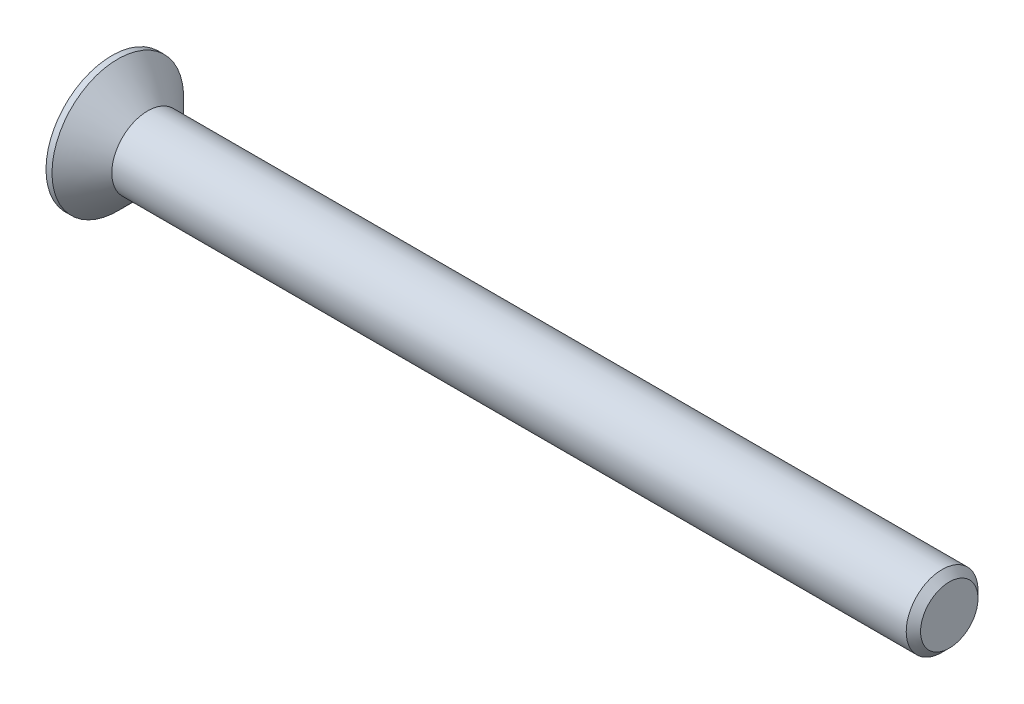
ISO-10303-21;
HEADER;
FILE_DESCRIPTION(('STEP AP214'),'2;1');
FILE_NAME('part.step','',(''),(''),'','','');
FILE_SCHEMA(('AUTOMOTIVE_DESIGN { 1 0 10303 214 1 1 1 1 }'));
ENDSEC;
DATA;
#1=APPLICATION_CONTEXT('core data for automotive mechanical design processes');
#2=APPLICATION_PROTOCOL_DEFINITION('international standard','automotive_design',2000,#1);
#3=PRODUCT_CONTEXT('',#1,'mechanical');
#4=PRODUCT('Part','Part','',(#3));
#5=PRODUCT_RELATED_PRODUCT_CATEGORY('part','',(#4));
#6=PRODUCT_DEFINITION_FORMATION('','',#4);
#7=PRODUCT_DEFINITION_CONTEXT('part definition',#1,'design');
#8=PRODUCT_DEFINITION('design','',#6,#7);
#9=PRODUCT_DEFINITION_SHAPE('','',#8);
#10=(LENGTH_UNIT() NAMED_UNIT(*) SI_UNIT(.MILLI.,.METRE.));
#11=(NAMED_UNIT(*) PLANE_ANGLE_UNIT() SI_UNIT($,.RADIAN.));
#12=(NAMED_UNIT(*) SI_UNIT($,.STERADIAN.) SOLID_ANGLE_UNIT());
#13=UNCERTAINTY_MEASURE_WITH_UNIT(LENGTH_MEASURE(1.E-05),#10,'distance_accuracy_value','');
#14=(GEOMETRIC_REPRESENTATION_CONTEXT(3) GLOBAL_UNCERTAINTY_ASSIGNED_CONTEXT((#13)) GLOBAL_UNIT_ASSIGNED_CONTEXT((#10,
#11,#12)) REPRESENTATION_CONTEXT('',''));
#15=CARTESIAN_POINT('',(0.,0.,0.));
#16=DIRECTION('',(0.,0.,1.));
#17=DIRECTION('',(1.,0.,0.));
#18=AXIS2_PLACEMENT_3D('',#15,#16,#17);
#19=CARTESIAN_POINT('',(0.,0.,0.));
#20=DIRECTION('',(-1.,0.,0.));
#21=DIRECTION('',(0.,0.,1.));
#22=AXIS2_PLACEMENT_3D('',#19,#20,#21);
#23=CONICAL_SURFACE('',#22,3.,0.78539816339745);
#24=CARTESIAN_POINT('',(-2.49999999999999,0.,0.));
#25=DIRECTION('',(-1.,0.,0.));
#26=DIRECTION('',(0.,0.,1.));
#27=AXIS2_PLACEMENT_3D('',#24,#25,#26);
#28=CIRCLE('',#27,5.5);
#29=CARTESIAN_POINT('',(-2.49999999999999,0.,5.5));
#30=VERTEX_POINT('',#29);
#31=EDGE_CURVE('E189',#30,#30,#28,.T.);
#32=ORIENTED_EDGE('',*,*,#31,.F.);
#33=EDGE_LOOP('',(#32));
#34=FACE_BOUND('',#33,.T.);
#35=CARTESIAN_POINT('',(0.,0.,0.));
#36=DIRECTION('',(-1.,0.,0.));
#37=DIRECTION('',(0.,0.,1.));
#38=AXIS2_PLACEMENT_3D('',#35,#36,#37);
#39=CIRCLE('',#38,3.);
#40=CARTESIAN_POINT('',(0.,0.,3.));
#41=VERTEX_POINT('',#40);
#42=EDGE_CURVE('E212',#41,#41,#39,.T.);
#43=ORIENTED_EDGE('',*,*,#42,.T.);
#44=EDGE_LOOP('',(#43));
#45=FACE_BOUND('',#44,.T.);
#46=ADVANCED_FACE('F33',(#34,#45),#23,.T.);
#47=CARTESIAN_POINT('',(-3.,0.,0.));
#48=DIRECTION('',(-1.,0.,0.));
#49=DIRECTION('',(0.,0.,1.));
#50=AXIS2_PLACEMENT_3D('',#47,#48,#49);
#51=CYLINDRICAL_SURFACE('',#50,3.);
#52=CARTESIAN_POINT('',(66.4,0.,0.));
#53=DIRECTION('',(-1.,0.,0.));
#54=DIRECTION('',(0.,0.,1.));
#55=AXIS2_PLACEMENT_3D('',#52,#53,#54);
#56=CIRCLE('',#55,3.);
#57=CARTESIAN_POINT('',(66.4,0.,3.));
#58=VERTEX_POINT('',#57);
#59=EDGE_CURVE('E41',#58,#58,#56,.T.);
#60=ORIENTED_EDGE('',*,*,#59,.T.);
#61=EDGE_LOOP('',(#60));
#62=FACE_BOUND('',#61,.T.);
#63=ORIENTED_EDGE('',*,*,#42,.F.);
#64=EDGE_LOOP('',(#63));
#65=FACE_BOUND('',#64,.T.);
#66=ADVANCED_FACE('F217',(#62,#65),#51,.T.);
#67=CARTESIAN_POINT('',(67.,0.,0.));
#68=DIRECTION('',(-1.,0.,0.));
#69=DIRECTION('',(0.,0.,1.));
#70=AXIS2_PLACEMENT_3D('',#67,#68,#69);
#71=PLANE('',#70);
#72=CARTESIAN_POINT('',(67.,0.,0.));
#73=DIRECTION('',(-1.,0.,0.));
#74=DIRECTION('',(0.,0.,1.));
#75=AXIS2_PLACEMENT_3D('',#72,#73,#74);
#76=CIRCLE('',#75,2.4);
#77=CARTESIAN_POINT('',(67.,0.,2.4));
#78=VERTEX_POINT('',#77);
#79=EDGE_CURVE('E11',#78,#78,#76,.F.);
#80=ORIENTED_EDGE('',*,*,#79,.T.);
#81=EDGE_LOOP('',(#80));
#82=FACE_BOUND('',#81,.T.);
#83=ADVANCED_FACE('F239',(#82),#71,.F.);
#84=CARTESIAN_POINT('',(-3.,5.5,0.));
#85=DIRECTION('',(1.,0.,0.));
#86=DIRECTION('',(0.,0.,-1.));
#87=AXIS2_PLACEMENT_3D('',#84,#85,#86);
#88=PLANE('',#87);
#89=DIRECTION('',(0.,0.,-1.));
#90=VECTOR('',#89,1.);
#91=CARTESIAN_POINT('',(-3.,0.825,-3.3));
#92=LINE('',#91,#90);
#93=CARTESIAN_POINT('',(-3.,0.825,-0.825));
#94=VERTEX_POINT('',#93);
#95=CARTESIAN_POINT('',(-3.,0.825,-3.3));
#96=VERTEX_POINT('',#95);
#97=EDGE_CURVE('E158',#94,#96,#92,.T.);
#98=ORIENTED_EDGE('',*,*,#97,.F.);
#99=DIRECTION('',(0.,-1.,0.));
#100=VECTOR('',#99,1.);
#101=CARTESIAN_POINT('',(-3.,0.825,-0.825));
#102=LINE('',#101,#100);
#103=CARTESIAN_POINT('',(-3.,3.3,-0.825));
#104=VERTEX_POINT('',#103);
#105=EDGE_CURVE('E48',#104,#94,#102,.T.);
#106=ORIENTED_EDGE('',*,*,#105,.F.);
#107=DIRECTION('',(0.,0.,-1.));
#108=VECTOR('',#107,1.);
#109=CARTESIAN_POINT('',(-3.,3.3,-0.825));
#110=LINE('',#109,#108);
#111=CARTESIAN_POINT('',(-3.,3.3,0.825));
#112=VERTEX_POINT('',#111);
#113=EDGE_CURVE('E185',#112,#104,#110,.T.);
#114=ORIENTED_EDGE('',*,*,#113,.F.);
#115=DIRECTION('',(0.,1.,0.));
#116=VECTOR('',#115,1.);
#117=CARTESIAN_POINT('',(-3.,3.3,0.825));
#118=LINE('',#117,#116);
#119=CARTESIAN_POINT('',(-3.,0.825,0.825));
#120=VERTEX_POINT('',#119);
#121=EDGE_CURVE('E183',#120,#112,#118,.T.);
#122=ORIENTED_EDGE('',*,*,#121,.F.);
#123=DIRECTION('',(0.,0.,-1.));
#124=VECTOR('',#123,1.);
#125=CARTESIAN_POINT('',(-3.,0.825,0.825));
#126=LINE('',#125,#124);
#127=CARTESIAN_POINT('',(-3.,0.825,3.3));
#128=VERTEX_POINT('',#127);
#129=EDGE_CURVE('E132',#128,#120,#126,.T.);
#130=ORIENTED_EDGE('',*,*,#129,.F.);
#131=DIRECTION('',(0.,1.,0.));
#132=VECTOR('',#131,1.);
#133=CARTESIAN_POINT('',(-3.,0.825,3.3));
#134=LINE('',#133,#132);
#135=CARTESIAN_POINT('',(-3.,-0.825,3.3));
#136=VERTEX_POINT('',#135);
#137=EDGE_CURVE('E179',#136,#128,#134,.T.);
#138=ORIENTED_EDGE('',*,*,#137,.F.);
#139=DIRECTION('',(0.,0.,1.));
#140=VECTOR('',#139,1.);
#141=CARTESIAN_POINT('',(-3.,-0.825,3.3));
#142=LINE('',#141,#140);
#143=CARTESIAN_POINT('',(-3.,-0.825,0.825));
#144=VERTEX_POINT('',#143);
#145=EDGE_CURVE('E176',#144,#136,#142,.T.);
#146=ORIENTED_EDGE('',*,*,#145,.F.);
#147=DIRECTION('',(0.,1.,0.));
#148=VECTOR('',#147,1.);
#149=CARTESIAN_POINT('',(-3.,-0.825,0.825));
#150=LINE('',#149,#148);
#151=CARTESIAN_POINT('',(-3.,-3.3,0.825));
#152=VERTEX_POINT('',#151);
#153=EDGE_CURVE('E173',#152,#144,#150,.T.);
#154=ORIENTED_EDGE('',*,*,#153,.F.);
#155=DIRECTION('',(0.,0.,1.));
#156=VECTOR('',#155,1.);
#157=CARTESIAN_POINT('',(-3.,-3.3,0.825));
#158=LINE('',#157,#156);
#159=CARTESIAN_POINT('',(-3.,-3.3,-0.825));
#160=VERTEX_POINT('',#159);
#161=EDGE_CURVE('E170',#160,#152,#158,.T.);
#162=ORIENTED_EDGE('',*,*,#161,.F.);
#163=DIRECTION('',(0.,-1.,0.));
#164=VECTOR('',#163,1.);
#165=CARTESIAN_POINT('',(-3.,-3.3,-0.825));
#166=LINE('',#165,#164);
#167=CARTESIAN_POINT('',(-3.,-0.825,-0.825));
#168=VERTEX_POINT('',#167);
#169=EDGE_CURVE('E167',#168,#160,#166,.T.);
#170=ORIENTED_EDGE('',*,*,#169,.F.);
#171=DIRECTION('',(0.,0.,1.));
#172=VECTOR('',#171,1.);
#173=CARTESIAN_POINT('',(-3.,-0.825,-0.825));
#174=LINE('',#173,#172);
#175=CARTESIAN_POINT('',(-3.,-0.825,-3.3));
#176=VERTEX_POINT('',#175);
#177=EDGE_CURVE('E164',#176,#168,#174,.T.);
#178=ORIENTED_EDGE('',*,*,#177,.F.);
#179=DIRECTION('',(0.,-1.,0.));
#180=VECTOR('',#179,1.);
#181=CARTESIAN_POINT('',(-3.,-0.825,-3.3));
#182=LINE('',#181,#180);
#183=EDGE_CURVE('E161',#96,#176,#182,.T.);
#184=ORIENTED_EDGE('',*,*,#183,.F.);
#185=EDGE_LOOP('',(#98,#106,#114,#122,#130,#138,#146,#154,#162,#170,#178,#184));
#186=FACE_BOUND('',#185,.T.);
#187=CARTESIAN_POINT('',(-3.,0.,0.));
#188=DIRECTION('',(-1.,0.,0.));
#189=DIRECTION('',(0.,0.,1.));
#190=AXIS2_PLACEMENT_3D('',#187,#188,#189);
#191=CIRCLE('',#190,5.5);
#192=CARTESIAN_POINT('',(-3.,0.,5.5));
#193=VERTEX_POINT('',#192);
#194=EDGE_CURVE('E209',#193,#193,#191,.T.);
#195=ORIENTED_EDGE('',*,*,#194,.T.);
#196=EDGE_LOOP('',(#195));
#197=FACE_BOUND('',#196,.T.);
#198=ADVANCED_FACE('F230',(#186,#197),#88,.F.);
#199=CARTESIAN_POINT('',(-3.,0.,0.));
#200=DIRECTION('',(-1.,0.,0.));
#201=DIRECTION('',(0.,0.,1.));
#202=AXIS2_PLACEMENT_3D('',#199,#200,#201);
#203=CYLINDRICAL_SURFACE('',#202,5.5);
#204=ORIENTED_EDGE('',*,*,#194,.F.);
#205=EDGE_LOOP('',(#204));
#206=FACE_BOUND('',#205,.T.);
#207=ORIENTED_EDGE('',*,*,#31,.T.);
#208=EDGE_LOOP('',(#207));
#209=FACE_BOUND('',#208,.T.);
#210=ADVANCED_FACE('F222',(#206,#209),#203,.T.);
#211=CARTESIAN_POINT('',(66.4,0.,0.));
#212=DIRECTION('',(-1.,0.,0.));
#213=DIRECTION('',(0.,0.,1.));
#214=AXIS2_PLACEMENT_3D('',#211,#212,#213);
#215=CONICAL_SURFACE('',#214,3.,0.785398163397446);
#216=ORIENTED_EDGE('',*,*,#79,.F.);
#217=EDGE_LOOP('',(#216));
#218=FACE_BOUND('',#217,.T.);
#219=ORIENTED_EDGE('',*,*,#59,.F.);
#220=EDGE_LOOP('',(#219));
#221=FACE_BOUND('',#220,.T.);
#222=ADVANCED_FACE('F35',(#218,#221),#215,.T.);
#223=CARTESIAN_POINT('',(-0.5,0.825,-0.825));
#224=DIRECTION('',(0.,0.,-1.));
#225=DIRECTION('',(-1.,0.,0.));
#226=AXIS2_PLACEMENT_3D('',#223,#224,#225);
#227=PLANE('',#226);
#228=ORIENTED_EDGE('',*,*,#105,.T.);
#229=DIRECTION('',(-1.,0.,0.));
#230=VECTOR('',#229,1.);
#231=CARTESIAN_POINT('',(-0.5,0.825,-0.825));
#232=LINE('',#231,#230);
#233=CARTESIAN_POINT('',(-0.5,0.825,-0.825));
#234=VERTEX_POINT('',#233);
#235=EDGE_CURVE('E96',#234,#94,#232,.T.);
#236=ORIENTED_EDGE('',*,*,#235,.F.);
#237=DIRECTION('',(0.,-1.,0.));
#238=VECTOR('',#237,1.);
#239=CARTESIAN_POINT('',(-0.5,0.825,-0.825));
#240=LINE('',#239,#238);
#241=CARTESIAN_POINT('',(-0.5,3.3,-0.825));
#242=VERTEX_POINT('',#241);
#243=EDGE_CURVE('E187',#242,#234,#240,.T.);
#244=ORIENTED_EDGE('',*,*,#243,.F.);
#245=DIRECTION('',(-1.,0.,0.));
#246=VECTOR('',#245,1.);
#247=CARTESIAN_POINT('',(-0.5,3.3,-0.825));
#248=LINE('',#247,#246);
#249=EDGE_CURVE('E56',#242,#104,#248,.T.);
#250=ORIENTED_EDGE('',*,*,#249,.T.);
#251=EDGE_LOOP('',(#228,#236,#244,#250));
#252=FACE_BOUND('',#251,.T.);
#253=ADVANCED_FACE('F221',(#252),#227,.F.);
#254=CARTESIAN_POINT('',(-0.5,3.3,-0.825));
#255=DIRECTION('',(0.,1.,0.));
#256=DIRECTION('',(-1.,0.,0.));
#257=AXIS2_PLACEMENT_3D('',#254,#255,#256);
#258=PLANE('',#257);
#259=ORIENTED_EDGE('',*,*,#113,.T.);
#260=ORIENTED_EDGE('',*,*,#249,.F.);
#261=DIRECTION('',(0.,0.,-1.));
#262=VECTOR('',#261,1.);
#263=CARTESIAN_POINT('',(-0.5,3.3,-0.825));
#264=LINE('',#263,#262);
#265=CARTESIAN_POINT('',(-0.5,3.3,0.825));
#266=VERTEX_POINT('',#265);
#267=EDGE_CURVE('E144',#266,#242,#264,.T.);
#268=ORIENTED_EDGE('',*,*,#267,.F.);
#269=DIRECTION('',(-1.,0.,0.));
#270=VECTOR('',#269,1.);
#271=CARTESIAN_POINT('',(-0.5,3.3,0.825));
#272=LINE('',#271,#270);
#273=EDGE_CURVE('E136',#266,#112,#272,.T.);
#274=ORIENTED_EDGE('',*,*,#273,.T.);
#275=EDGE_LOOP('',(#259,#260,#268,#274));
#276=FACE_BOUND('',#275,.T.);
#277=ADVANCED_FACE('F228',(#276),#258,.F.);
#278=CARTESIAN_POINT('',(-0.5,3.3,0.825));
#279=DIRECTION('',(0.,0.,1.));
#280=DIRECTION('',(1.,0.,0.));
#281=AXIS2_PLACEMENT_3D('',#278,#279,#280);
#282=PLANE('',#281);
#283=ORIENTED_EDGE('',*,*,#121,.T.);
#284=ORIENTED_EDGE('',*,*,#273,.F.);
#285=DIRECTION('',(0.,1.,0.));
#286=VECTOR('',#285,1.);
#287=CARTESIAN_POINT('',(-0.5,3.3,0.825));
#288=LINE('',#287,#286);
#289=CARTESIAN_POINT('',(-0.5,0.825,0.825));
#290=VERTEX_POINT('',#289);
#291=EDGE_CURVE('E140',#290,#266,#288,.T.);
#292=ORIENTED_EDGE('',*,*,#291,.F.);
#293=DIRECTION('',(-1.,0.,0.));
#294=VECTOR('',#293,1.);
#295=CARTESIAN_POINT('',(-0.5,0.825,0.825));
#296=LINE('',#295,#294);
#297=EDGE_CURVE('E125',#290,#120,#296,.T.);
#298=ORIENTED_EDGE('',*,*,#297,.T.);
#299=EDGE_LOOP('',(#283,#284,#292,#298));
#300=FACE_BOUND('',#299,.T.);
#301=ADVANCED_FACE('F141',(#300),#282,.F.);
#302=CARTESIAN_POINT('',(-0.5,0.825,0.825));
#303=DIRECTION('',(0.,1.,0.));
#304=DIRECTION('',(-1.,0.,0.));
#305=AXIS2_PLACEMENT_3D('',#302,#303,#304);
#306=PLANE('',#305);
#307=ORIENTED_EDGE('',*,*,#129,.T.);
#308=ORIENTED_EDGE('',*,*,#297,.F.);
#309=DIRECTION('',(0.,0.,-1.));
#310=VECTOR('',#309,1.);
#311=CARTESIAN_POINT('',(-0.5,0.825,0.825));
#312=LINE('',#311,#310);
#313=CARTESIAN_POINT('',(-0.5,0.825,3.3));
#314=VERTEX_POINT('',#313);
#315=EDGE_CURVE('E129',#314,#290,#312,.T.);
#316=ORIENTED_EDGE('',*,*,#315,.F.);
#317=DIRECTION('',(-1.,0.,0.));
#318=VECTOR('',#317,1.);
#319=CARTESIAN_POINT('',(-0.5,0.825,3.3));
#320=LINE('',#319,#318);
#321=EDGE_CURVE('E137',#314,#128,#320,.T.);
#322=ORIENTED_EDGE('',*,*,#321,.T.);
#323=EDGE_LOOP('',(#307,#308,#316,#322));
#324=FACE_BOUND('',#323,.T.);
#325=ADVANCED_FACE('F127',(#324),#306,.F.);
#326=CARTESIAN_POINT('',(-0.5,0.825,3.3));
#327=DIRECTION('',(0.,0.,1.));
#328=DIRECTION('',(1.,0.,0.));
#329=AXIS2_PLACEMENT_3D('',#326,#327,#328);
#330=PLANE('',#329);
#331=ORIENTED_EDGE('',*,*,#137,.T.);
#332=ORIENTED_EDGE('',*,*,#321,.F.);
#333=DIRECTION('',(0.,1.,0.));
#334=VECTOR('',#333,1.);
#335=CARTESIAN_POINT('',(-0.5,0.825,3.3));
#336=LINE('',#335,#334);
#337=CARTESIAN_POINT('',(-0.5,-0.825,3.3));
#338=VERTEX_POINT('',#337);
#339=EDGE_CURVE('E150',#338,#314,#336,.T.);
#340=ORIENTED_EDGE('',*,*,#339,.F.);
#341=DIRECTION('',(-1.,0.,0.));
#342=VECTOR('',#341,1.);
#343=CARTESIAN_POINT('',(-0.5,-0.825,3.3));
#344=LINE('',#343,#342);
#345=EDGE_CURVE('E192',#338,#136,#344,.T.);
#346=ORIENTED_EDGE('',*,*,#345,.T.);
#347=EDGE_LOOP('',(#331,#332,#340,#346));
#348=FACE_BOUND('',#347,.T.);
#349=ADVANCED_FACE('F277',(#348),#330,.F.);
#350=CARTESIAN_POINT('',(-0.5,-0.825,3.3));
#351=DIRECTION('',(0.,-1.,0.));
#352=DIRECTION('',(1.,0.,0.));
#353=AXIS2_PLACEMENT_3D('',#350,#351,#352);
#354=PLANE('',#353);
#355=ORIENTED_EDGE('',*,*,#145,.T.);
#356=ORIENTED_EDGE('',*,*,#345,.F.);
#357=DIRECTION('',(0.,0.,1.));
#358=VECTOR('',#357,1.);
#359=CARTESIAN_POINT('',(-0.5,-0.825,3.3));
#360=LINE('',#359,#358);
#361=CARTESIAN_POINT('',(-0.5,-0.825,0.825));
#362=VERTEX_POINT('',#361);
#363=EDGE_CURVE('E152',#362,#338,#360,.T.);
#364=ORIENTED_EDGE('',*,*,#363,.F.);
#365=DIRECTION('',(-1.,0.,0.));
#366=VECTOR('',#365,1.);
#367=CARTESIAN_POINT('',(-0.5,-0.825,0.825));
#368=LINE('',#367,#366);
#369=EDGE_CURVE('E194',#362,#144,#368,.T.);
#370=ORIENTED_EDGE('',*,*,#369,.T.);
#371=EDGE_LOOP('',(#355,#356,#364,#370));
#372=FACE_BOUND('',#371,.T.);
#373=ADVANCED_FACE('F273',(#372),#354,.F.);
#374=CARTESIAN_POINT('',(-0.5,-0.825,0.825));
#375=DIRECTION('',(0.,0.,1.));
#376=DIRECTION('',(1.,0.,0.));
#377=AXIS2_PLACEMENT_3D('',#374,#375,#376);
#378=PLANE('',#377);
#379=ORIENTED_EDGE('',*,*,#153,.T.);
#380=ORIENTED_EDGE('',*,*,#369,.F.);
#381=DIRECTION('',(0.,1.,0.));
#382=VECTOR('',#381,1.);
#383=CARTESIAN_POINT('',(-0.5,-0.825,0.825));
#384=LINE('',#383,#382);
#385=CARTESIAN_POINT('',(-0.5,-3.3,0.825));
#386=VERTEX_POINT('',#385);
#387=EDGE_CURVE('E422',#386,#362,#384,.T.);
#388=ORIENTED_EDGE('',*,*,#387,.F.);
#389=DIRECTION('',(-1.,0.,0.));
#390=VECTOR('',#389,1.);
#391=CARTESIAN_POINT('',(-0.5,-3.3,0.825));
#392=LINE('',#391,#390);
#393=EDGE_CURVE('E196',#386,#152,#392,.T.);
#394=ORIENTED_EDGE('',*,*,#393,.T.);
#395=EDGE_LOOP('',(#379,#380,#388,#394));
#396=FACE_BOUND('',#395,.T.);
#397=ADVANCED_FACE('F269',(#396),#378,.F.);
#398=CARTESIAN_POINT('',(-0.5,-3.3,0.825));
#399=DIRECTION('',(0.,-1.,0.));
#400=DIRECTION('',(1.,0.,0.));
#401=AXIS2_PLACEMENT_3D('',#398,#399,#400);
#402=PLANE('',#401);
#403=ORIENTED_EDGE('',*,*,#161,.T.);
#404=ORIENTED_EDGE('',*,*,#393,.F.);
#405=DIRECTION('',(0.,0.,1.));
#406=VECTOR('',#405,1.);
#407=CARTESIAN_POINT('',(-0.5,-3.3,0.825));
#408=LINE('',#407,#406);
#409=CARTESIAN_POINT('',(-0.5,-3.3,-0.825));
#410=VERTEX_POINT('',#409);
#411=EDGE_CURVE('E419',#410,#386,#408,.T.);
#412=ORIENTED_EDGE('',*,*,#411,.F.);
#413=DIRECTION('',(-1.,0.,0.));
#414=VECTOR('',#413,1.);
#415=CARTESIAN_POINT('',(-0.5,-3.3,-0.825));
#416=LINE('',#415,#414);
#417=EDGE_CURVE('E198',#410,#160,#416,.T.);
#418=ORIENTED_EDGE('',*,*,#417,.T.);
#419=EDGE_LOOP('',(#403,#404,#412,#418));
#420=FACE_BOUND('',#419,.T.);
#421=ADVANCED_FACE('F265',(#420),#402,.F.);
#422=CARTESIAN_POINT('',(-0.5,-3.3,-0.825));
#423=DIRECTION('',(0.,0.,-1.));
#424=DIRECTION('',(-1.,0.,0.));
#425=AXIS2_PLACEMENT_3D('',#422,#423,#424);
#426=PLANE('',#425);
#427=ORIENTED_EDGE('',*,*,#169,.T.);
#428=ORIENTED_EDGE('',*,*,#417,.F.);
#429=DIRECTION('',(0.,-1.,0.));
#430=VECTOR('',#429,1.);
#431=CARTESIAN_POINT('',(-0.5,-3.3,-0.825));
#432=LINE('',#431,#430);
#433=CARTESIAN_POINT('',(-0.5,-0.825,-0.825));
#434=VERTEX_POINT('',#433);
#435=EDGE_CURVE('E416',#434,#410,#432,.T.);
#436=ORIENTED_EDGE('',*,*,#435,.F.);
#437=DIRECTION('',(-1.,0.,0.));
#438=VECTOR('',#437,1.);
#439=CARTESIAN_POINT('',(-0.5,-0.825,-0.825));
#440=LINE('',#439,#438);
#441=EDGE_CURVE('E200',#434,#168,#440,.T.);
#442=ORIENTED_EDGE('',*,*,#441,.T.);
#443=EDGE_LOOP('',(#427,#428,#436,#442));
#444=FACE_BOUND('',#443,.T.);
#445=ADVANCED_FACE('F261',(#444),#426,.F.);
#446=CARTESIAN_POINT('',(-0.5,-0.825,-0.825));
#447=DIRECTION('',(0.,-1.,0.));
#448=DIRECTION('',(1.,0.,0.));
#449=AXIS2_PLACEMENT_3D('',#446,#447,#448);
#450=PLANE('',#449);
#451=ORIENTED_EDGE('',*,*,#177,.T.);
#452=ORIENTED_EDGE('',*,*,#441,.F.);
#453=DIRECTION('',(0.,0.,1.));
#454=VECTOR('',#453,1.);
#455=CARTESIAN_POINT('',(-0.5,-0.825,-0.825));
#456=LINE('',#455,#454);
#457=CARTESIAN_POINT('',(-0.5,-0.825,-3.3));
#458=VERTEX_POINT('',#457);
#459=EDGE_CURVE('E413',#458,#434,#456,.T.);
#460=ORIENTED_EDGE('',*,*,#459,.F.);
#461=DIRECTION('',(-1.,0.,0.));
#462=VECTOR('',#461,1.);
#463=CARTESIAN_POINT('',(-0.5,-0.825,-3.3));
#464=LINE('',#463,#462);
#465=EDGE_CURVE('E202',#458,#176,#464,.T.);
#466=ORIENTED_EDGE('',*,*,#465,.T.);
#467=EDGE_LOOP('',(#451,#452,#460,#466));
#468=FACE_BOUND('',#467,.T.);
#469=ADVANCED_FACE('F257',(#468),#450,.F.);
#470=CARTESIAN_POINT('',(-0.5,-0.825,-3.3));
#471=DIRECTION('',(0.,0.,-1.));
#472=DIRECTION('',(-1.,0.,0.));
#473=AXIS2_PLACEMENT_3D('',#470,#471,#472);
#474=PLANE('',#473);
#475=ORIENTED_EDGE('',*,*,#183,.T.);
#476=ORIENTED_EDGE('',*,*,#465,.F.);
#477=DIRECTION('',(0.,-1.,0.));
#478=VECTOR('',#477,1.);
#479=CARTESIAN_POINT('',(-0.5,-0.825,-3.3));
#480=LINE('',#479,#478);
#481=CARTESIAN_POINT('',(-0.5,0.825,-3.3));
#482=VERTEX_POINT('',#481);
#483=EDGE_CURVE('E408',#482,#458,#480,.T.);
#484=ORIENTED_EDGE('',*,*,#483,.F.);
#485=DIRECTION('',(-1.,0.,0.));
#486=VECTOR('',#485,1.);
#487=CARTESIAN_POINT('',(-0.5,0.825,-3.3));
#488=LINE('',#487,#486);
#489=EDGE_CURVE('E204',#482,#96,#488,.T.);
#490=ORIENTED_EDGE('',*,*,#489,.T.);
#491=EDGE_LOOP('',(#475,#476,#484,#490));
#492=FACE_BOUND('',#491,.T.);
#493=ADVANCED_FACE('F253',(#492),#474,.F.);
#494=CARTESIAN_POINT('',(-0.5,0.825,-3.3));
#495=DIRECTION('',(0.,1.,0.));
#496=DIRECTION('',(-1.,0.,0.));
#497=AXIS2_PLACEMENT_3D('',#494,#495,#496);
#498=PLANE('',#497);
#499=ORIENTED_EDGE('',*,*,#97,.T.);
#500=ORIENTED_EDGE('',*,*,#489,.F.);
#501=DIRECTION('',(0.,0.,-1.));
#502=VECTOR('',#501,1.);
#503=CARTESIAN_POINT('',(-0.5,0.825,-3.3));
#504=LINE('',#503,#502);
#505=EDGE_CURVE('E406',#234,#482,#504,.T.);
#506=ORIENTED_EDGE('',*,*,#505,.F.);
#507=ORIENTED_EDGE('',*,*,#235,.T.);
#508=EDGE_LOOP('',(#499,#500,#506,#507));
#509=FACE_BOUND('',#508,.T.);
#510=ADVANCED_FACE('F250',(#509),#498,.F.);
#511=CARTESIAN_POINT('',(-0.5,0.,0.));
#512=DIRECTION('',(1.,0.,0.));
#513=DIRECTION('',(0.,0.,-1.));
#514=AXIS2_PLACEMENT_3D('',#511,#512,#513);
#515=PLANE('',#514);
#516=ORIENTED_EDGE('',*,*,#243,.T.);
#517=ORIENTED_EDGE('',*,*,#505,.T.);
#518=ORIENTED_EDGE('',*,*,#483,.T.);
#519=ORIENTED_EDGE('',*,*,#459,.T.);
#520=ORIENTED_EDGE('',*,*,#435,.T.);
#521=ORIENTED_EDGE('',*,*,#411,.T.);
#522=ORIENTED_EDGE('',*,*,#387,.T.);
#523=ORIENTED_EDGE('',*,*,#363,.T.);
#524=ORIENTED_EDGE('',*,*,#339,.T.);
#525=ORIENTED_EDGE('',*,*,#315,.T.);
#526=ORIENTED_EDGE('',*,*,#291,.T.);
#527=ORIENTED_EDGE('',*,*,#267,.T.);
#528=EDGE_LOOP('',(#516,#517,#518,#519,#520,#521,#522,#523,#524,#525,#526,#527));
#529=FACE_BOUND('',#528,.T.);
#530=ADVANCED_FACE('F147',(#529),#515,.F.);
#531=CLOSED_SHELL('',(#46,#66,#83,#198,#210,#222,#253,#277,#301,#325,#349,#373,#397,#421,#445,
#469,#493,#510,#530));
#532=MANIFOLD_SOLID_BREP('B2',#531);
#533=ADVANCED_BREP_SHAPE_REPRESENTATION('',(#18,#532),#14);
#534=SHAPE_DEFINITION_REPRESENTATION(#9,#533);
ENDSEC;
END-ISO-10303-21;
